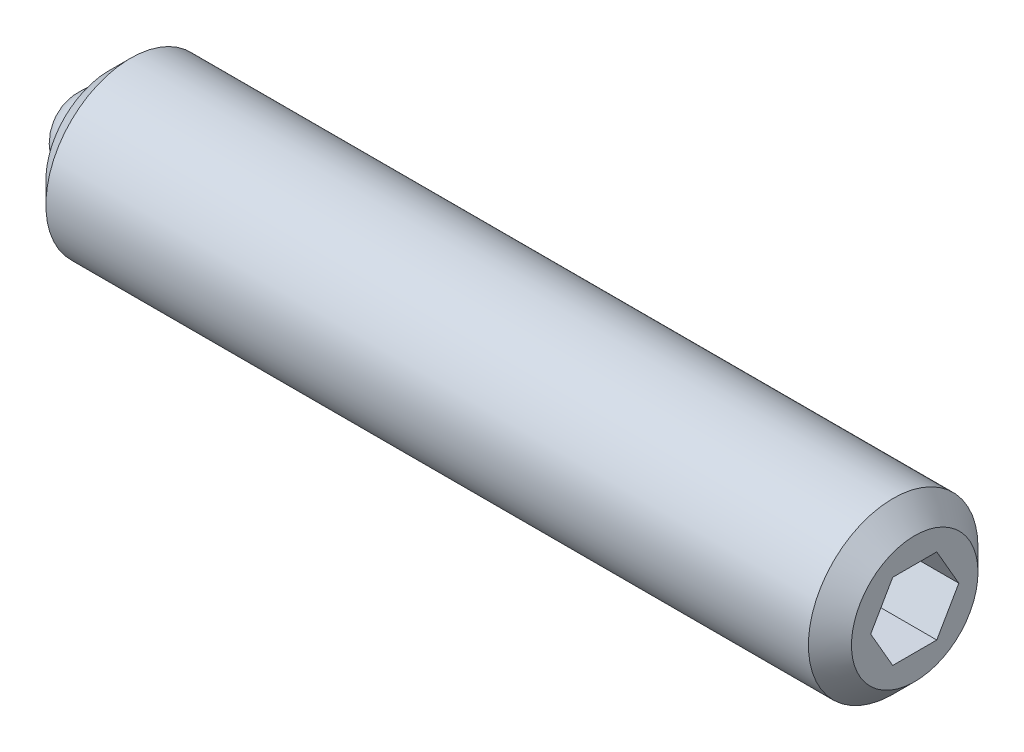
ISO-10303-21;
HEADER;
FILE_DESCRIPTION(('STEP AP214'),'2;1');
FILE_NAME('part.step','',(''),(''),'','','');
FILE_SCHEMA(('AUTOMOTIVE_DESIGN { 1 0 10303 214 1 1 1 1 }'));
ENDSEC;
DATA;
#1=APPLICATION_CONTEXT('core data for automotive mechanical design processes');
#2=APPLICATION_PROTOCOL_DEFINITION('international standard','automotive_design',2000,#1);
#3=PRODUCT_CONTEXT('',#1,'mechanical');
#4=PRODUCT('Part','Part','',(#3));
#5=PRODUCT_RELATED_PRODUCT_CATEGORY('part','',(#4));
#6=PRODUCT_DEFINITION_FORMATION('','',#4);
#7=PRODUCT_DEFINITION_CONTEXT('part definition',#1,'design');
#8=PRODUCT_DEFINITION('design','',#6,#7);
#9=PRODUCT_DEFINITION_SHAPE('','',#8);
#10=(LENGTH_UNIT() NAMED_UNIT(*) SI_UNIT(.MILLI.,.METRE.));
#11=(NAMED_UNIT(*) PLANE_ANGLE_UNIT() SI_UNIT($,.RADIAN.));
#12=(NAMED_UNIT(*) SI_UNIT($,.STERADIAN.) SOLID_ANGLE_UNIT());
#13=UNCERTAINTY_MEASURE_WITH_UNIT(LENGTH_MEASURE(1.E-05),#10,'distance_accuracy_value','');
#14=(GEOMETRIC_REPRESENTATION_CONTEXT(3) GLOBAL_UNCERTAINTY_ASSIGNED_CONTEXT((#13)) GLOBAL_UNIT_ASSIGNED_CONTEXT((#10,
#11,#12)) REPRESENTATION_CONTEXT('',''));
#15=CARTESIAN_POINT('',(0.,0.,0.));
#16=DIRECTION('',(0.,0.,1.));
#17=DIRECTION('',(1.,0.,0.));
#18=AXIS2_PLACEMENT_3D('',#15,#16,#17);
#19=CARTESIAN_POINT('',(0.,0.,0.));
#20=DIRECTION('',(0.,-1.,0.));
#21=DIRECTION('',(0.,0.,-1.));
#22=AXIS2_PLACEMENT_3D('',#19,#20,#21);
#23=SPHERICAL_SURFACE('',#22,0.5);
#24=CARTESIAN_POINT('',(0.,-0.5,0.));
#25=VERTEX_POINT('',#24);
#26=VERTEX_LOOP('',#25);
#27=FACE_BOUND('',#26,.T.);
#28=ADVANCED_FACE('F40',(#27),#23,.T.);
#29=CLOSED_SHELL('',(#28));
#30=MANIFOLD_SOLID_BREP('B2',#29);
#31=CARTESIAN_POINT('',(9.5,0.,0.));
#32=DIRECTION('',(-1.,0.,0.));
#33=DIRECTION('',(0.,0.,1.));
#34=AXIS2_PLACEMENT_3D('',#31,#32,#33);
#35=CYLINDRICAL_SURFACE('',#34,1.);
#36=CARTESIAN_POINT('',(9.246,0.,0.));
#37=DIRECTION('',(1.,0.,0.));
#38=DIRECTION('',(0.,0.,-1.));
#39=AXIS2_PLACEMENT_3D('',#36,#37,#38);
#40=CIRCLE('',#39,1.);
#41=CARTESIAN_POINT('',(9.246,0.,-1.));
#42=VERTEX_POINT('',#41);
#43=EDGE_CURVE('E38',#42,#42,#40,.F.);
#44=ORIENTED_EDGE('',*,*,#43,.T.);
#45=EDGE_LOOP('',(#44));
#46=FACE_BOUND('',#45,.T.);
#47=CARTESIAN_POINT('',(0.254000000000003,0.,0.));
#48=DIRECTION('',(1.,0.,0.));
#49=DIRECTION('',(0.,0.,-1.));
#50=AXIS2_PLACEMENT_3D('',#47,#48,#49);
#51=CIRCLE('',#50,1.);
#52=CARTESIAN_POINT('',(0.254000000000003,0.,-1.));
#53=VERTEX_POINT('',#52);
#54=EDGE_CURVE('E155',#53,#53,#51,.T.);
#55=ORIENTED_EDGE('',*,*,#54,.T.);
#56=EDGE_LOOP('',(#55));
#57=FACE_BOUND('',#56,.T.);
#58=ADVANCED_FACE('F52',(#46,#57),#35,.T.);
#59=CARTESIAN_POINT('',(9.5,0.,0.));
#60=DIRECTION('',(1.,0.,0.));
#61=DIRECTION('',(0.,0.,-1.));
#62=AXIS2_PLACEMENT_3D('',#59,#60,#61);
#63=PLANE('',#62);
#64=DIRECTION('',(0.,0.866025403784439,-0.5));
#65=VECTOR('',#64,1.);
#66=CARTESIAN_POINT('',(9.5,-0.45,-0.259807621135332));
#67=LINE('',#66,#65);
#68=CARTESIAN_POINT('',(9.5,-0.45,-0.259807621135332));
#69=VERTEX_POINT('',#68);
#70=CARTESIAN_POINT('',(9.5,0.,-0.519615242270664));
#71=VERTEX_POINT('',#70);
#72=EDGE_CURVE('E67',#69,#71,#67,.T.);
#73=ORIENTED_EDGE('',*,*,#72,.F.);
#74=DIRECTION('',(0.,0.,-1.));
#75=VECTOR('',#74,1.);
#76=CARTESIAN_POINT('',(9.5,-0.45,0.259807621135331));
#77=LINE('',#76,#75);
#78=CARTESIAN_POINT('',(9.5,-0.45,0.259807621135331));
#79=VERTEX_POINT('',#78);
#80=EDGE_CURVE('E151',#79,#69,#77,.T.);
#81=ORIENTED_EDGE('',*,*,#80,.F.);
#82=DIRECTION('',(0.,-0.866025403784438,-0.5));
#83=VECTOR('',#82,1.);
#84=CARTESIAN_POINT('',(9.5,0.,0.519615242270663));
#85=LINE('',#84,#83);
#86=CARTESIAN_POINT('',(9.5,0.,0.519615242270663));
#87=VERTEX_POINT('',#86);
#88=EDGE_CURVE('E149',#87,#79,#85,.T.);
#89=ORIENTED_EDGE('',*,*,#88,.F.);
#90=DIRECTION('',(0.,-0.866025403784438,0.5));
#91=VECTOR('',#90,1.);
#92=CARTESIAN_POINT('',(9.5,0.45,0.259807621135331));
#93=LINE('',#92,#91);
#94=CARTESIAN_POINT('',(9.5,0.45,0.259807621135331));
#95=VERTEX_POINT('',#94);
#96=EDGE_CURVE('E115',#95,#87,#93,.T.);
#97=ORIENTED_EDGE('',*,*,#96,.F.);
#98=DIRECTION('',(0.,0.,1.));
#99=VECTOR('',#98,1.);
#100=CARTESIAN_POINT('',(9.5,0.45,-0.259807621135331));
#101=LINE('',#100,#99);
#102=CARTESIAN_POINT('',(9.5,0.45,-0.259807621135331));
#103=VERTEX_POINT('',#102);
#104=EDGE_CURVE('E145',#103,#95,#101,.T.);
#105=ORIENTED_EDGE('',*,*,#104,.F.);
#106=DIRECTION('',(0.,0.866025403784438,0.5));
#107=VECTOR('',#106,1.);
#108=CARTESIAN_POINT('',(9.5,0.,-0.519615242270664));
#109=LINE('',#108,#107);
#110=EDGE_CURVE('E141',#71,#103,#109,.T.);
#111=ORIENTED_EDGE('',*,*,#110,.F.);
#112=EDGE_LOOP('',(#73,#81,#89,#97,#105,#111));
#113=FACE_BOUND('',#112,.T.);
#114=CARTESIAN_POINT('',(9.5,0.,0.));
#115=DIRECTION('',(1.,0.,0.));
#116=DIRECTION('',(0.,0.,-1.));
#117=AXIS2_PLACEMENT_3D('',#114,#115,#116);
#118=CIRCLE('',#117,0.745999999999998);
#119=CARTESIAN_POINT('',(9.5,0.,-0.745999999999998));
#120=VERTEX_POINT('',#119);
#121=EDGE_CURVE('E60',#120,#120,#118,.T.);
#122=ORIENTED_EDGE('',*,*,#121,.T.);
#123=EDGE_LOOP('',(#122));
#124=FACE_BOUND('',#123,.T.);
#125=ADVANCED_FACE('F168',(#113,#124),#63,.T.);
#126=CARTESIAN_POINT('',(0.,0.,0.));
#127=DIRECTION('',(1.,0.,0.));
#128=DIRECTION('',(0.,0.,-1.));
#129=AXIS2_PLACEMENT_3D('',#126,#127,#128);
#130=PLANE('',#129);
#131=CARTESIAN_POINT('',(0.,0.,0.));
#132=DIRECTION('',(-1.,0.,0.));
#133=DIRECTION('',(0.,0.,1.));
#134=AXIS2_PLACEMENT_3D('',#131,#132,#133);
#135=CIRCLE('',#134,0.5);
#136=CARTESIAN_POINT('',(0.,0.,0.5));
#137=VERTEX_POINT('',#136);
#138=EDGE_CURVE('E223',#137,#137,#135,.T.);
#139=ORIENTED_EDGE('',*,*,#138,.F.);
#140=EDGE_LOOP('',(#139));
#141=FACE_BOUND('',#140,.T.);
#142=CARTESIAN_POINT('',(0.,0.,0.));
#143=DIRECTION('',(1.,0.,0.));
#144=DIRECTION('',(0.,0.,-1.));
#145=AXIS2_PLACEMENT_3D('',#142,#143,#144);
#146=CIRCLE('',#145,0.745999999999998);
#147=CARTESIAN_POINT('',(0.,0.,-0.745999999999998));
#148=VERTEX_POINT('',#147);
#149=EDGE_CURVE('E163',#148,#148,#146,.F.);
#150=ORIENTED_EDGE('',*,*,#149,.T.);
#151=EDGE_LOOP('',(#150));
#152=FACE_BOUND('',#151,.T.);
#153=ADVANCED_FACE('F180',(#141,#152),#130,.F.);
#154=CARTESIAN_POINT('',(0.254000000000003,0.,0.));
#155=DIRECTION('',(1.,0.,0.));
#156=DIRECTION('',(0.,0.,-1.));
#157=AXIS2_PLACEMENT_3D('',#154,#155,#156);
#158=CONICAL_SURFACE('',#157,1.,0.785398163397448);
#159=ORIENTED_EDGE('',*,*,#149,.F.);
#160=EDGE_LOOP('',(#159));
#161=FACE_BOUND('',#160,.T.);
#162=ORIENTED_EDGE('',*,*,#54,.F.);
#163=EDGE_LOOP('',(#162));
#164=FACE_BOUND('',#163,.T.);
#165=ADVANCED_FACE('F172',(#161,#164),#158,.T.);
#166=CARTESIAN_POINT('',(9.5,0.,0.));
#167=DIRECTION('',(-1.,0.,0.));
#168=DIRECTION('',(0.,0.,1.));
#169=AXIS2_PLACEMENT_3D('',#166,#167,#168);
#170=CONICAL_SURFACE('',#169,0.745999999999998,0.785398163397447);
#171=ORIENTED_EDGE('',*,*,#43,.F.);
#172=EDGE_LOOP('',(#171));
#173=FACE_BOUND('',#172,.T.);
#174=ORIENTED_EDGE('',*,*,#121,.F.);
#175=EDGE_LOOP('',(#174));
#176=FACE_BOUND('',#175,.T.);
#177=ADVANCED_FACE('F54',(#173,#176),#170,.T.);
#178=CARTESIAN_POINT('',(7.5,-0.45,-0.259807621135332));
#179=DIRECTION('',(0.,-0.5,-0.866025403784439));
#180=DIRECTION('',(0.,0.866025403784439,-0.5));
#181=AXIS2_PLACEMENT_3D('',#178,#179,#180);
#182=PLANE('',#181);
#183=ORIENTED_EDGE('',*,*,#72,.T.);
#184=DIRECTION('',(1.,0.,0.));
#185=VECTOR('',#184,1.);
#186=CARTESIAN_POINT('',(7.5,0.,-0.519615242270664));
#187=LINE('',#186,#185);
#188=CARTESIAN_POINT('',(7.5,0.,-0.519615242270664));
#189=VERTEX_POINT('',#188);
#190=EDGE_CURVE('E97',#189,#71,#187,.T.);
#191=ORIENTED_EDGE('',*,*,#190,.F.);
#192=DIRECTION('',(0.,0.866025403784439,-0.5));
#193=VECTOR('',#192,1.);
#194=CARTESIAN_POINT('',(7.5,-0.45,-0.259807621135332));
#195=LINE('',#194,#193);
#196=CARTESIAN_POINT('',(7.5,-0.45,-0.259807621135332));
#197=VERTEX_POINT('',#196);
#198=EDGE_CURVE('E153',#197,#189,#195,.T.);
#199=ORIENTED_EDGE('',*,*,#198,.F.);
#200=DIRECTION('',(1.,0.,0.));
#201=VECTOR('',#200,1.);
#202=CARTESIAN_POINT('',(7.5,-0.45,-0.259807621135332));
#203=LINE('',#202,#201);
#204=EDGE_CURVE('E75',#197,#69,#203,.T.);
#205=ORIENTED_EDGE('',*,*,#204,.T.);
#206=EDGE_LOOP('',(#183,#191,#199,#205));
#207=FACE_BOUND('',#206,.T.);
#208=ADVANCED_FACE('F171',(#207),#182,.F.);
#209=CARTESIAN_POINT('',(7.5,-0.45,0.259807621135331));
#210=DIRECTION('',(0.,-1.,0.));
#211=DIRECTION('',(0.,0.,-1.));
#212=AXIS2_PLACEMENT_3D('',#209,#210,#211);
#213=PLANE('',#212);
#214=ORIENTED_EDGE('',*,*,#80,.T.);
#215=ORIENTED_EDGE('',*,*,#204,.F.);
#216=DIRECTION('',(0.,0.,-1.));
#217=VECTOR('',#216,1.);
#218=CARTESIAN_POINT('',(7.5,-0.45,0.259807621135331));
#219=LINE('',#218,#217);
#220=CARTESIAN_POINT('',(7.5,-0.45,0.259807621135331));
#221=VERTEX_POINT('',#220);
#222=EDGE_CURVE('E127',#221,#197,#219,.T.);
#223=ORIENTED_EDGE('',*,*,#222,.F.);
#224=DIRECTION('',(1.,0.,0.));
#225=VECTOR('',#224,1.);
#226=CARTESIAN_POINT('',(7.5,-0.45,0.259807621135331));
#227=LINE('',#226,#225);
#228=EDGE_CURVE('E119',#221,#79,#227,.T.);
#229=ORIENTED_EDGE('',*,*,#228,.T.);
#230=EDGE_LOOP('',(#214,#215,#223,#229));
#231=FACE_BOUND('',#230,.T.);
#232=ADVANCED_FACE('F178',(#231),#213,.F.);
#233=CARTESIAN_POINT('',(7.5,0.,0.519615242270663));
#234=DIRECTION('',(0.,-0.5,0.866025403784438));
#235=DIRECTION('',(0.,-0.866025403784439,-0.5));
#236=AXIS2_PLACEMENT_3D('',#233,#234,#235);
#237=PLANE('',#236);
#238=ORIENTED_EDGE('',*,*,#88,.T.);
#239=ORIENTED_EDGE('',*,*,#228,.F.);
#240=DIRECTION('',(0.,-0.866025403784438,-0.5));
#241=VECTOR('',#240,1.);
#242=CARTESIAN_POINT('',(7.5,0.,0.519615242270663));
#243=LINE('',#242,#241);
#244=CARTESIAN_POINT('',(7.5,0.,0.519615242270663));
#245=VERTEX_POINT('',#244);
#246=EDGE_CURVE('E123',#245,#221,#243,.T.);
#247=ORIENTED_EDGE('',*,*,#246,.F.);
#248=DIRECTION('',(1.,0.,0.));
#249=VECTOR('',#248,1.);
#250=CARTESIAN_POINT('',(7.5,0.,0.519615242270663));
#251=LINE('',#250,#249);
#252=EDGE_CURVE('E108',#245,#87,#251,.T.);
#253=ORIENTED_EDGE('',*,*,#252,.T.);
#254=EDGE_LOOP('',(#238,#239,#247,#253));
#255=FACE_BOUND('',#254,.T.);
#256=ADVANCED_FACE('F124',(#255),#237,.F.);
#257=CARTESIAN_POINT('',(7.5,0.45,0.259807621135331));
#258=DIRECTION('',(0.,0.5,0.866025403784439));
#259=DIRECTION('',(0.,-0.866025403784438,0.5));
#260=AXIS2_PLACEMENT_3D('',#257,#258,#259);
#261=PLANE('',#260);
#262=ORIENTED_EDGE('',*,*,#96,.T.);
#263=ORIENTED_EDGE('',*,*,#252,.F.);
#264=DIRECTION('',(0.,-0.866025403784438,0.5));
#265=VECTOR('',#264,1.);
#266=CARTESIAN_POINT('',(7.5,0.45,0.259807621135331));
#267=LINE('',#266,#265);
#268=CARTESIAN_POINT('',(7.5,0.45,0.259807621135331));
#269=VERTEX_POINT('',#268);
#270=EDGE_CURVE('E112',#269,#245,#267,.T.);
#271=ORIENTED_EDGE('',*,*,#270,.F.);
#272=DIRECTION('',(1.,0.,0.));
#273=VECTOR('',#272,1.);
#274=CARTESIAN_POINT('',(7.5,0.45,0.259807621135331));
#275=LINE('',#274,#273);
#276=EDGE_CURVE('E120',#269,#95,#275,.T.);
#277=ORIENTED_EDGE('',*,*,#276,.T.);
#278=EDGE_LOOP('',(#262,#263,#271,#277));
#279=FACE_BOUND('',#278,.T.);
#280=ADVANCED_FACE('F110',(#279),#261,.F.);
#281=CARTESIAN_POINT('',(7.5,0.45,-0.259807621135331));
#282=DIRECTION('',(0.,1.,0.));
#283=DIRECTION('',(0.,0.,1.));
#284=AXIS2_PLACEMENT_3D('',#281,#282,#283);
#285=PLANE('',#284);
#286=ORIENTED_EDGE('',*,*,#104,.T.);
#287=ORIENTED_EDGE('',*,*,#276,.F.);
#288=DIRECTION('',(0.,0.,1.));
#289=VECTOR('',#288,1.);
#290=CARTESIAN_POINT('',(7.5,0.45,-0.259807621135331));
#291=LINE('',#290,#289);
#292=CARTESIAN_POINT('',(7.5,0.45,-0.259807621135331));
#293=VERTEX_POINT('',#292);
#294=EDGE_CURVE('E133',#293,#269,#291,.T.);
#295=ORIENTED_EDGE('',*,*,#294,.F.);
#296=DIRECTION('',(1.,0.,0.));
#297=VECTOR('',#296,1.);
#298=CARTESIAN_POINT('',(7.5,0.45,-0.259807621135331));
#299=LINE('',#298,#297);
#300=EDGE_CURVE('E158',#293,#103,#299,.T.);
#301=ORIENTED_EDGE('',*,*,#300,.T.);
#302=EDGE_LOOP('',(#286,#287,#295,#301));
#303=FACE_BOUND('',#302,.T.);
#304=ADVANCED_FACE('F199',(#303),#285,.F.);
#305=CARTESIAN_POINT('',(7.5,0.,-0.519615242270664));
#306=DIRECTION('',(0.,0.5,-0.866025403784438));
#307=DIRECTION('',(0.,0.866025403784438,0.5));
#308=AXIS2_PLACEMENT_3D('',#305,#306,#307);
#309=PLANE('',#308);
#310=ORIENTED_EDGE('',*,*,#110,.T.);
#311=ORIENTED_EDGE('',*,*,#300,.F.);
#312=DIRECTION('',(0.,0.866025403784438,0.5));
#313=VECTOR('',#312,1.);
#314=CARTESIAN_POINT('',(7.5,0.,-0.519615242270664));
#315=LINE('',#314,#313);
#316=EDGE_CURVE('E135',#189,#293,#315,.T.);
#317=ORIENTED_EDGE('',*,*,#316,.F.);
#318=ORIENTED_EDGE('',*,*,#190,.T.);
#319=EDGE_LOOP('',(#310,#311,#317,#318));
#320=FACE_BOUND('',#319,.T.);
#321=ADVANCED_FACE('F196',(#320),#309,.F.);
#322=CARTESIAN_POINT('',(7.5,0.,0.));
#323=DIRECTION('',(1.,0.,0.));
#324=DIRECTION('',(0.,0.,-1.));
#325=AXIS2_PLACEMENT_3D('',#322,#323,#324);
#326=PLANE('',#325);
#327=ORIENTED_EDGE('',*,*,#198,.T.);
#328=ORIENTED_EDGE('',*,*,#316,.T.);
#329=ORIENTED_EDGE('',*,*,#294,.T.);
#330=ORIENTED_EDGE('',*,*,#270,.T.);
#331=ORIENTED_EDGE('',*,*,#246,.T.);
#332=ORIENTED_EDGE('',*,*,#222,.T.);
#333=EDGE_LOOP('',(#327,#328,#329,#330,#331,#332));
#334=FACE_BOUND('',#333,.T.);
#335=ADVANCED_FACE('F130',(#334),#326,.T.);
#336=CARTESIAN_POINT('',(0.5,0.,0.));
#337=DIRECTION('',(-1.,0.,0.));
#338=DIRECTION('',(0.,0.,1.));
#339=AXIS2_PLACEMENT_3D('',#336,#337,#338);
#340=CYLINDRICAL_SURFACE('',#339,0.5);
#341=CARTESIAN_POINT('',(0.5,0.,0.));
#342=DIRECTION('',(-1.,0.,0.));
#343=DIRECTION('',(0.,0.,1.));
#344=AXIS2_PLACEMENT_3D('',#341,#342,#343);
#345=CIRCLE('',#344,0.5);
#346=CARTESIAN_POINT('',(0.5,0.,0.5));
#347=VERTEX_POINT('',#346);
#348=EDGE_CURVE('E142',#347,#347,#345,.T.);
#349=ORIENTED_EDGE('',*,*,#348,.F.);
#350=EDGE_LOOP('',(#349));
#351=FACE_BOUND('',#350,.T.);
#352=ORIENTED_EDGE('',*,*,#138,.T.);
#353=EDGE_LOOP('',(#352));
#354=FACE_BOUND('',#353,.T.);
#355=ADVANCED_FACE('F212',(#351,#354),#340,.F.);
#356=CARTESIAN_POINT('',(0.5,0.,0.));
#357=DIRECTION('',(-1.,0.,0.));
#358=DIRECTION('',(0.,0.,1.));
#359=AXIS2_PLACEMENT_3D('',#356,#357,#358);
#360=PLANE('',#359);
#361=ORIENTED_EDGE('',*,*,#348,.T.);
#362=EDGE_LOOP('',(#361));
#363=FACE_BOUND('',#362,.T.);
#364=ADVANCED_FACE('F215',(#363),#360,.T.);
#365=CLOSED_SHELL('',(#58,#125,#153,#165,#177,#208,#232,#256,#280,#304,#321,#335,#355,#364));
#366=MANIFOLD_SOLID_BREP('B6',#365);
#367=ADVANCED_BREP_SHAPE_REPRESENTATION('',(#18,#30,#366),#14);
#368=SHAPE_DEFINITION_REPRESENTATION(#9,#367);
ENDSEC;
END-ISO-10303-21;
